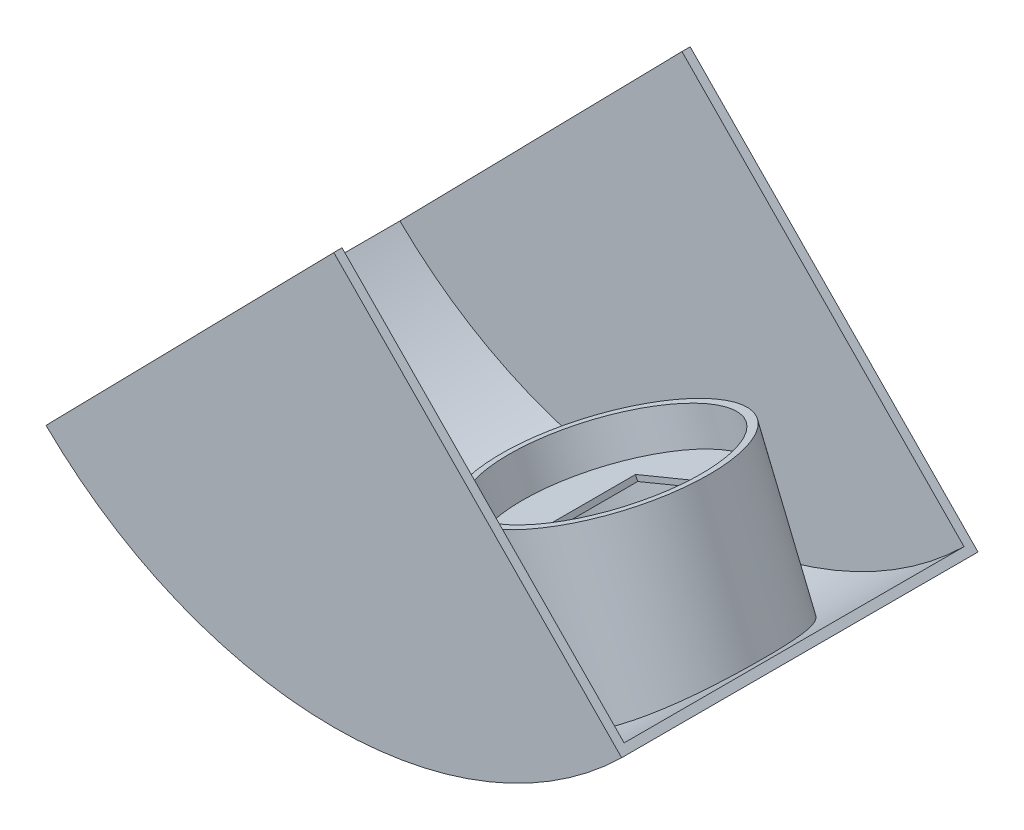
ISO-10303-21;
HEADER;
FILE_DESCRIPTION(('STEP AP214'),'2;1');
FILE_NAME('part.step','',(''),(''),'','','');
FILE_SCHEMA(('AUTOMOTIVE_DESIGN { 1 0 10303 214 1 1 1 1 }'));
ENDSEC;
DATA;
#1=APPLICATION_CONTEXT('core data for automotive mechanical design processes');
#2=APPLICATION_PROTOCOL_DEFINITION('international standard','automotive_design',2000,#1);
#3=PRODUCT_CONTEXT('',#1,'mechanical');
#4=PRODUCT('Part','Part','',(#3));
#5=PRODUCT_RELATED_PRODUCT_CATEGORY('part','',(#4));
#6=PRODUCT_DEFINITION_FORMATION('','',#4);
#7=PRODUCT_DEFINITION_CONTEXT('part definition',#1,'design');
#8=PRODUCT_DEFINITION('design','',#6,#7);
#9=PRODUCT_DEFINITION_SHAPE('','',#8);
#10=(LENGTH_UNIT() NAMED_UNIT(*) SI_UNIT(.MILLI.,.METRE.));
#11=(NAMED_UNIT(*) PLANE_ANGLE_UNIT() SI_UNIT($,.RADIAN.));
#12=(NAMED_UNIT(*) SI_UNIT($,.STERADIAN.) SOLID_ANGLE_UNIT());
#13=UNCERTAINTY_MEASURE_WITH_UNIT(LENGTH_MEASURE(1.E-05),#10,'distance_accuracy_value','');
#14=(GEOMETRIC_REPRESENTATION_CONTEXT(3) GLOBAL_UNCERTAINTY_ASSIGNED_CONTEXT((#13)) GLOBAL_UNIT_ASSIGNED_CONTEXT((#10,
#11,#12)) REPRESENTATION_CONTEXT('',''));
#15=CARTESIAN_POINT('',(0.,0.,0.));
#16=DIRECTION('',(0.,0.,1.));
#17=DIRECTION('',(1.,0.,0.));
#18=AXIS2_PLACEMENT_3D('',#15,#16,#17);
#19=CARTESIAN_POINT('',(68.1806278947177,-165.197568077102,0.));
#20=DIRECTION('',(-0.381506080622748,0.92436632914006,0.));
#21=DIRECTION('',(-0.92436632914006,-0.381506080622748,0.));
#22=AXIS2_PLACEMENT_3D('',#19,#20,#21);
#23=CYLINDRICAL_SURFACE('',#22,38.);
#24=CARTESIAN_POINT('',(20.2332278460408,-148.6291239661,0.));
#25=CARTESIAN_POINT('',(20.2332328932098,-148.629124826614,-1.04878184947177));
#26=CARTESIAN_POINT('',(20.2777466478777,-148.623084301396,-2.09764961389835));
#27=CARTESIAN_POINT('',(20.4553392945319,-148.598744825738,-4.18778060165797));
#28=CARTESIAN_POINT('',(20.5884279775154,-148.58044452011,-5.22904297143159));
#29=CARTESIAN_POINT('',(20.9418353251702,-148.531045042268,-7.29689111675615));
#30=CARTESIAN_POINT('',(21.1621980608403,-148.499939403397,-8.32346920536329));
#31=CARTESIAN_POINT('',(21.6878414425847,-148.424081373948,-10.3540863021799));
#32=CARTESIAN_POINT('',(21.9931200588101,-148.379329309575,-11.3581258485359));
#33=CARTESIAN_POINT('',(22.6850564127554,-148.275117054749,-13.3354483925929));
#34=CARTESIAN_POINT('',(23.0716052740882,-148.215676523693,-14.3087705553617));
#35=CARTESIAN_POINT('',(23.9226099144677,-148.080701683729,-16.2195643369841));
#36=CARTESIAN_POINT('',(24.3870660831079,-148.00516729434,-17.157035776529));
#37=CARTESIAN_POINT('',(25.389641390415,-147.836478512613,-18.9900658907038));
#38=CARTESIAN_POINT('',(25.9277616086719,-147.743323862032,-19.8856239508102));
#39=CARTESIAN_POINT('',(27.0729811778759,-147.537764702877,-21.6291581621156));
#40=CARTESIAN_POINT('',(27.6800815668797,-147.425359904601,-22.4771335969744));
#41=CARTESIAN_POINT('',(28.9712649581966,-147.177126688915,-24.1369698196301));
#42=CARTESIAN_POINT('',(29.6566650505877,-147.040867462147,-24.9477419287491));
#43=CARTESIAN_POINT('',(31.0883729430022,-146.74483736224,-26.5089803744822));
#44=CARTESIAN_POINT('',(31.8346815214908,-146.585066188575,-27.2594459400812));
#45=CARTESIAN_POINT('',(33.3823022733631,-146.240385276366,-28.6952105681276));
#46=CARTESIAN_POINT('',(34.1836195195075,-146.055473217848,-29.3805036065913));
#47=CARTESIAN_POINT('',(35.8349280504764,-145.65911845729,-30.6812296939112));
#48=CARTESIAN_POINT('',(36.6849195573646,-145.447675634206,-31.2966624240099));
#49=CARTESIAN_POINT('',(38.4395651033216,-144.993905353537,-32.4616979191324));
#50=CARTESIAN_POINT('',(39.3448298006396,-144.751177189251,-33.010225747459));
#51=CARTESIAN_POINT('',(41.1915383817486,-144.236527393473,-34.0268466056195));
#52=CARTESIAN_POINT('',(42.1329827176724,-143.964605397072,-34.4949386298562));
#53=CARTESIAN_POINT('',(44.0444564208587,-143.391356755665,-35.3469369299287));
#54=CARTESIAN_POINT('',(45.0144824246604,-143.09003356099,-35.730853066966));
#55=CARTESIAN_POINT('',(46.9754620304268,-142.45829880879,-36.4113835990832));
#56=CARTESIAN_POINT('',(47.9664151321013,-142.127887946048,-36.7080000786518));
#57=CARTESIAN_POINT('',(49.9405632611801,-141.44613071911,-37.2061492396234));
#58=CARTESIAN_POINT('',(50.9234917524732,-141.095361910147,-37.4095293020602));
#59=CARTESIAN_POINT('',(52.8942195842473,-140.368459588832,-37.7283956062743));
#60=CARTESIAN_POINT('',(53.8820188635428,-139.992326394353,-37.8438829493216));
#61=CARTESIAN_POINT('',(55.8547962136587,-139.216970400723,-37.9859451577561));
#62=CARTESIAN_POINT('',(56.8397746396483,-138.817750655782,-38.0125317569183));
#63=CARTESIAN_POINT('',(58.7996172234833,-137.999031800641,-37.9765893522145));
#64=CARTESIAN_POINT('',(59.7744815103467,-137.579532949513,-37.914061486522));
#65=CARTESIAN_POINT('',(61.6848843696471,-136.733468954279,-37.7028871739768));
#66=CARTESIAN_POINT('',(62.6208127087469,-136.307283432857,-37.556238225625));
#67=CARTESIAN_POINT('',(64.4698725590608,-135.442523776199,-37.1796001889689));
#68=CARTESIAN_POINT('',(65.3830044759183,-135.0039498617,-36.9496125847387));
#69=CARTESIAN_POINT('',(67.1806412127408,-134.11847551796,-36.408146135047));
#70=CARTESIAN_POINT('',(68.0651450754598,-133.671574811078,-36.0966645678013));
#71=CARTESIAN_POINT('',(69.8001282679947,-132.77385375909,-35.3946399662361));
#72=CARTESIAN_POINT('',(70.650607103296,-132.323033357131,-35.0040957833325));
#73=CARTESIAN_POINT('',(72.320314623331,-131.417967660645,-34.1429202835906));
#74=CARTESIAN_POINT('',(73.1391839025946,-130.963729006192,-33.6715853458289));
#75=CARTESIAN_POINT('',(74.73282208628,-130.060924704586,-32.654793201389));
#76=CARTESIAN_POINT('',(75.5075908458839,-129.612359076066,-32.1093357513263));
#77=CARTESIAN_POINT('',(77.0091490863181,-128.725876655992,-30.9479955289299));
#78=CARTESIAN_POINT('',(77.7359314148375,-128.287961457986,-30.3321022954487));
#79=CARTESIAN_POINT('',(79.1378390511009,-127.427935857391,-29.0340480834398));
#80=CARTESIAN_POINT('',(79.8129633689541,-127.005825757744,-28.3518858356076));
#81=CARTESIAN_POINT('',(81.1263811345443,-126.171044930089,-26.9058365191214));
#82=CARTESIAN_POINT('',(81.7631289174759,-125.758962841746,-26.1402047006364));
#83=CARTESIAN_POINT('',(82.9755720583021,-124.962317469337,-24.5486351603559));
#84=CARTESIAN_POINT('',(83.5512662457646,-124.577754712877,-23.722696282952));
#85=CARTESIAN_POINT('',(84.63881323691,-123.841441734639,-22.0158909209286));
#86=CARTESIAN_POINT('',(85.150662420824,-123.489693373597,-21.1350213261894));
#87=CARTESIAN_POINT('',(86.1079252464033,-122.824123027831,-19.3242105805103));
#88=CARTESIAN_POINT('',(86.5533391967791,-122.510300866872,-18.3942696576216));
#89=CARTESIAN_POINT('',(87.3775447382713,-121.923836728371,-16.4866595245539));
#90=CARTESIAN_POINT('',(87.7559828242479,-121.651414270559,-15.5087699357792));
#91=CARTESIAN_POINT('',(88.4413510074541,-121.154062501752,-13.516502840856));
#92=CARTESIAN_POINT('',(88.7482806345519,-120.929133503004,-12.5021250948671));
#93=CARTESIAN_POINT('',(89.2888165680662,-120.53057746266,-10.4443572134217));
#94=CARTESIAN_POINT('',(89.5224361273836,-120.356941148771,-9.40097235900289));
#95=CARTESIAN_POINT('',(89.9150154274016,-120.063941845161,-7.29275892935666));
#96=CARTESIAN_POINT('',(90.0739771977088,-119.944577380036,-6.22793093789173));
#97=CARTESIAN_POINT('',(90.3129705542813,-119.764723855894,-4.11398678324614));
#98=CARTESIAN_POINT('',(90.3950247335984,-119.702726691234,-3.06522704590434));
#99=CARTESIAN_POINT('',(90.4870393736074,-119.633185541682,-0.962757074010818));
#100=CARTESIAN_POINT('',(90.4970011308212,-119.625640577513,0.0909530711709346));
#101=CARTESIAN_POINT('',(90.4447739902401,-119.665132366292,2.19546033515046));
#102=CARTESIAN_POINT('',(90.3825913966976,-119.712164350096,3.24625770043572));
#103=CARTESIAN_POINT('',(90.1864646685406,-119.859987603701,5.33731206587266));
#104=CARTESIAN_POINT('',(90.0525208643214,-119.96077862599,6.37756911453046));
#105=CARTESIAN_POINT('',(89.7165482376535,-120.212246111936,8.42251605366));
#106=CARTESIAN_POINT('',(89.5157117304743,-120.362048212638,9.42750993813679));
#107=CARTESIAN_POINT('',(89.0465892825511,-120.709527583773,11.4131548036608));
#108=CARTESIAN_POINT('',(88.7783043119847,-120.907204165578,12.393806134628));
#109=CARTESIAN_POINT('',(88.1756901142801,-121.347380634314,14.324353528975));
#110=CARTESIAN_POINT('',(87.8413548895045,-121.589884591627,15.2742467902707));
#111=CARTESIAN_POINT('',(87.108356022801,-122.116083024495,17.1370834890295));
#112=CARTESIAN_POINT('',(86.7096910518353,-122.399778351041,18.0500261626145));
#113=CARTESIAN_POINT('',(85.8413350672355,-123.010375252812,19.8511470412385));
#114=CARTESIAN_POINT('',(85.3703786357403,-123.33802999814,20.7384599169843));
#115=CARTESIAN_POINT('',(84.365836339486,-124.027321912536,22.4630129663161));
#116=CARTESIAN_POINT('',(83.8322497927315,-124.388959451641,23.300252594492));
#117=CARTESIAN_POINT('',(82.704889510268,-125.14136181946,24.9194915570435));
#118=CARTESIAN_POINT('',(82.1111069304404,-125.532130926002,25.7014827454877));
#119=CARTESIAN_POINT('',(80.8662002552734,-126.337671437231,27.2051427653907));
#120=CARTESIAN_POINT('',(80.2150753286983,-126.752443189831,27.9268107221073));
#121=CARTESIAN_POINT('',(78.8410438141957,-127.61176691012,29.3229724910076));
#122=CARTESIAN_POINT('',(78.1167184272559,-128.05681117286,29.9957682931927));
#123=CARTESIAN_POINT('',(76.6146696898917,-128.961082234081,31.2682970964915));
#124=CARTESIAN_POINT('',(75.8369453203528,-129.420309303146,31.8680287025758));
#125=CARTESIAN_POINT('',(74.2323054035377,-130.347317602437,32.9900464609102));
#126=CARTESIAN_POINT('',(73.4053913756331,-130.81509856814,33.5123350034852));
#127=CARTESIAN_POINT('',(71.707067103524,-131.753700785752,34.4755048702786));
#128=CARTESIAN_POINT('',(70.8356575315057,-132.224521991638,34.9163874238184));
#129=CARTESIAN_POINT('',(69.0602119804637,-133.160379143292,35.7102855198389));
#130=CARTESIAN_POINT('',(68.1564646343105,-133.625432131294,36.0639262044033));
#131=CARTESIAN_POINT('',(66.3160959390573,-134.548262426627,36.6846229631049));
#132=CARTESIAN_POINT('',(65.3794746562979,-135.006039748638,36.9516792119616));
#133=CARTESIAN_POINT('',(63.4798646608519,-135.909575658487,37.3968791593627));
#134=CARTESIAN_POINT('',(62.5168803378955,-136.355336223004,37.5750375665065));
#135=CARTESIAN_POINT('',(60.5712788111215,-137.230674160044,37.840929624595));
#136=CARTESIAN_POINT('',(59.5886620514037,-137.660251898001,37.9286653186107));
#137=CARTESIAN_POINT('',(57.6385901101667,-138.487846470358,38.0117609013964));
#138=CARTESIAN_POINT('',(56.6714718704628,-138.88640851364,38.0096188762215));
#139=CARTESIAN_POINT('',(54.7326017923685,-139.661850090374,37.9191504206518));
#140=CARTESIAN_POINT('',(53.7608500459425,-140.038730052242,37.8308256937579));
#141=CARTESIAN_POINT('',(51.8199158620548,-140.768502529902,37.56874954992));
#142=CARTESIAN_POINT('',(50.8507333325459,-141.121395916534,37.3950012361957));
#143=CARTESIAN_POINT('',(48.9221146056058,-141.801524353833,36.9635294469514));
#144=CARTESIAN_POINT('',(47.9626784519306,-142.128759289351,36.7058055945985));
#145=CARTESIAN_POINT('',(46.0661360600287,-142.754694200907,36.1101767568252));
#146=CARTESIAN_POINT('',(45.128933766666,-143.053546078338,35.77273678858));
#147=CARTESIAN_POINT('',(43.2781321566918,-143.62430569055,35.0195104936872));
#148=CARTESIAN_POINT('',(42.3645326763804,-143.896213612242,34.6037247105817));
#149=CARTESIAN_POINT('',(40.5675098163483,-144.413127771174,33.6968304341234));
#150=CARTESIAN_POINT('',(39.6840893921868,-144.658131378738,33.2057145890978));
#151=CARTESIAN_POINT('',(37.953925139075,-145.121679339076,32.1516466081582));
#152=CARTESIAN_POINT('',(37.1071820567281,-145.340223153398,31.5886930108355));
#153=CARTESIAN_POINT('',(35.4362994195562,-145.756743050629,30.3801029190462));
#154=CARTESIAN_POINT('',(34.613222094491,-145.954083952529,29.7327784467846));
#155=CARTESIAN_POINT('',(33.0183602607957,-146.323128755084,28.3710992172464));
#156=CARTESIAN_POINT('',(32.2465766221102,-146.494832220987,27.6567433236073));
#157=CARTESIAN_POINT('',(30.760167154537,-146.814134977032,26.1655196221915));
#158=CARTESIAN_POINT('',(30.0455554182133,-146.961728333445,25.3886364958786));
#159=CARTESIAN_POINT('',(28.6794630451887,-147.234417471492,23.7775307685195));
#160=CARTESIAN_POINT('',(28.0279824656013,-147.359513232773,22.9433081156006));
#161=CARTESIAN_POINT('',(26.7816682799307,-147.591164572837,21.2062363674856));
#162=CARTESIAN_POINT('',(26.1881723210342,-147.697315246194,20.3023727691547));
#163=CARTESIAN_POINT('',(25.0778243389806,-147.889892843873,18.4466593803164));
#164=CARTESIAN_POINT('',(24.5609759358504,-147.976318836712,17.4948073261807));
#165=CARTESIAN_POINT('',(23.6092167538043,-148.131149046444,15.5503243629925));
#166=CARTESIAN_POINT('',(23.1742540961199,-148.19956468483,14.5577197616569));
#167=CARTESIAN_POINT('',(22.3902959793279,-148.32003294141,12.5382480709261));
#168=CARTESIAN_POINT('',(22.0412876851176,-148.372088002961,11.51138612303));
#169=CARTESIAN_POINT('',(21.4889265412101,-148.45298469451,9.62258003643));
#170=CARTESIAN_POINT('',(21.2705863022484,-148.484335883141,8.76509138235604));
#171=CARTESIAN_POINT('',(20.8951198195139,-148.537638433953,7.03660810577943));
#172=CARTESIAN_POINT('',(20.7379850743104,-148.559591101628,6.16561537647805));
#173=CARTESIAN_POINT('',(20.4860982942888,-148.594535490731,4.41454014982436));
#174=CARTESIAN_POINT('',(20.391341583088,-148.6075278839,3.53445833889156));
#175=CARTESIAN_POINT('',(20.2649002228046,-148.624822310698,1.7696051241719));
#176=CARTESIAN_POINT('',(20.2332235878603,-148.629123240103,0.884833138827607));
#177=CARTESIAN_POINT('',(20.2332278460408,-148.6291239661,0.));
#178=B_SPLINE_CURVE_WITH_KNOTS('',3,(#24,#25,#26,#27,#28,#29,#30,#31,#32,#33,#34,#35,#36,#37,
#38,#39,#40,#41,#42,#43,#44,#45,#46,#47,#48,#49,#50,#51,#52,#53,#54,#55,#56,#57,#58,#59,#60,#61,
#62,#63,#64,#65,#66,#67,#68,#69,#70,#71,#72,#73,#74,#75,#76,#77,#78,#79,#80,#81,#82,#83,#84,#85,
#86,#87,#88,#89,#90,#91,#92,#93,#94,#95,#96,#97,#98,#99,#100,#101,#102,#103,#104,#105,#106,#107,
#108,#109,#110,#111,#112,#113,#114,#115,#116,#117,#118,#119,#120,#121,#122,#123,#124,#125,#126,
#127,#128,#129,#130,#131,#132,#133,#134,#135,#136,#137,#138,#139,#140,#141,#142,#143,#144,#145,
#146,#147,#148,#149,#150,#151,#152,#153,#154,#155,#156,#157,#158,#159,#160,#161,#162,#163,#164,
#165,#166,#167,#168,#169,#170,#171,#172,#173,#174,#175,#176,#177),.UNSPECIFIED.,.T.,.F.,(4,2,2,
2,2,2,2,2,2,2,2,2,2,2,2,2,2,2,2,2,2,2,2,2,2,2,2,2,2,2,2,2,2,2,2,2,2,2,2,2,2,2,2,2,2,2,2,2,2,2,2,
2,2,2,2,2,2,2,2,2,2,2,2,2,2,2,2,2,2,2,2,2,2,2,2,2,4),(0.,3.14553625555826,6.29142027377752,
9.43889490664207,12.5862943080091,15.7295037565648,18.8727289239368,22.0160001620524,
25.1593187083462,28.366718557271,31.5741594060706,34.7818964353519,37.9896481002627,
41.2435671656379,44.4975269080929,47.7511052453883,51.0046058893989,54.1905136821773,
57.3763815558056,60.5618289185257,63.7472355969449,66.8599616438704,69.9726322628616,
73.0854068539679,76.1982266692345,79.3396790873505,82.4811418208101,85.6230717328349,
88.7650618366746,91.9943994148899,95.2237988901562,98.4533813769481,101.682948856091,
104.929084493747,108.175241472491,111.420811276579,114.666292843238,117.823806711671,
120.98126379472,124.13844498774,127.295611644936,130.399273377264,133.502890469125,
136.606789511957,139.710752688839,142.877041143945,146.043364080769,149.210152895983,
152.376987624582,155.625547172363,158.874168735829,162.122690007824,165.3711622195,
168.595632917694,171.820097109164,175.044027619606,178.267885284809,181.40219913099,
184.53645102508,187.670589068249,190.804741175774,193.921043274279,197.037323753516,
200.153908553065,203.270556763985,206.463571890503,209.656641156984,212.850495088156,
216.044351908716,219.29991616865,222.555634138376,225.809282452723,229.06244462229,
231.716491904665,234.370170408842,237.023649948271,239.677466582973),.UNSPECIFIED.);
#179=CARTESIAN_POINT('',(20.2332278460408,-148.6291239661,0.));
#180=VERTEX_POINT('',#179);
#181=EDGE_CURVE('E151',#180,#180,#178,.T.);
#182=ORIENTED_EDGE('',*,*,#181,.T.);
#183=EDGE_LOOP('',(#182));
#184=FACE_BOUND('',#183,.T.);
#185=CARTESIAN_POINT('',(39.7062289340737,-96.2058088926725,0.));
#186=DIRECTION('',(-0.381506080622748,0.92436632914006,0.));
#187=DIRECTION('',(-0.92436632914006,-0.381506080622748,0.));
#188=AXIS2_PLACEMENT_3D('',#185,#186,#187);
#189=CIRCLE('',#188,38.);
#190=CARTESIAN_POINT('',(4.58030842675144,-110.703039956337,0.));
#191=VERTEX_POINT('',#190);
#192=EDGE_CURVE('E11',#191,#191,#189,.F.);
#193=ORIENTED_EDGE('',*,*,#192,.F.);
#194=EDGE_LOOP('',(#193));
#195=FACE_BOUND('',#194,.T.);
#196=ADVANCED_FACE('F32',(#184,#195),#23,.F.);
#197=CARTESIAN_POINT('',(0.,0.,65.));
#198=DIRECTION('',(-0.714142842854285,-0.7,0.));
#199=DIRECTION('',(0.7,-0.714142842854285,0.));
#200=AXIS2_PLACEMENT_3D('',#197,#198,#199);
#201=PLANE('',#200);
#202=DIRECTION('',(-0.7,0.714142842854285,0.));
#203=VECTOR('',#202,1.);
#204=CARTESIAN_POINT('',(0.,0.,-62.));
#205=LINE('',#204,#203);
#206=CARTESIAN_POINT('',(102.9,-104.97899789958,-62.));
#207=VERTEX_POINT('',#206);
#208=CARTESIAN_POINT('',(0.,0.,-62.));
#209=VERTEX_POINT('',#208);
#210=EDGE_CURVE('E222',#207,#209,#205,.T.);
#211=ORIENTED_EDGE('',*,*,#210,.F.);
#212=DIRECTION('',(0.,0.,1.));
#213=VECTOR('',#212,1.);
#214=CARTESIAN_POINT('',(102.9,-104.97899789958,-62.));
#215=LINE('',#214,#213);
#216=CARTESIAN_POINT('',(102.9,-104.97899789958,62.));
#217=VERTEX_POINT('',#216);
#218=EDGE_CURVE('E230',#207,#217,#215,.T.);
#219=ORIENTED_EDGE('',*,*,#218,.T.);
#220=DIRECTION('',(-0.7,0.714142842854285,0.));
#221=VECTOR('',#220,1.);
#222=CARTESIAN_POINT('',(0.,0.,62.));
#223=LINE('',#222,#221);
#224=CARTESIAN_POINT('',(0.,0.,62.));
#225=VERTEX_POINT('',#224);
#226=EDGE_CURVE('E211',#217,#225,#223,.T.);
#227=ORIENTED_EDGE('',*,*,#226,.T.);
#228=DIRECTION('',(0.,0.,-1.));
#229=VECTOR('',#228,1.);
#230=CARTESIAN_POINT('',(0.,0.,65.));
#231=LINE('',#230,#229);
#232=CARTESIAN_POINT('',(0.,0.,65.));
#233=VERTEX_POINT('',#232);
#234=EDGE_CURVE('E40',#233,#225,#231,.T.);
#235=ORIENTED_EDGE('',*,*,#234,.F.);
#236=DIRECTION('',(-0.7,0.714142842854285,0.));
#237=VECTOR('',#236,1.);
#238=CARTESIAN_POINT('',(0.,0.,65.));
#239=LINE('',#238,#237);
#240=CARTESIAN_POINT('',(105.,-107.121426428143,65.));
#241=VERTEX_POINT('',#240);
#242=EDGE_CURVE('E242',#241,#233,#239,.T.);
#243=ORIENTED_EDGE('',*,*,#242,.F.);
#244=DIRECTION('',(0.,0.,-1.));
#245=VECTOR('',#244,1.);
#246=CARTESIAN_POINT('',(105.,-107.121426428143,65.));
#247=LINE('',#246,#245);
#248=CARTESIAN_POINT('',(105.,-107.121426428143,-65.));
#249=VERTEX_POINT('',#248);
#250=EDGE_CURVE('E249',#241,#249,#247,.T.);
#251=ORIENTED_EDGE('',*,*,#250,.T.);
#252=DIRECTION('',(-0.7,0.714142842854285,0.));
#253=VECTOR('',#252,1.);
#254=CARTESIAN_POINT('',(0.,0.,-65.));
#255=LINE('',#254,#253);
#256=CARTESIAN_POINT('',(0.,0.,-65.));
#257=VERTEX_POINT('',#256);
#258=EDGE_CURVE('E233',#249,#257,#255,.T.);
#259=ORIENTED_EDGE('',*,*,#258,.T.);
#260=EDGE_CURVE('E254',#209,#257,#231,.T.);
#261=ORIENTED_EDGE('',*,*,#260,.F.);
#262=EDGE_LOOP('',(#211,#219,#227,#235,#243,#251,#259,#261));
#263=FACE_BOUND('',#262,.T.);
#264=ADVANCED_FACE('F34',(#263),#201,.F.);
#265=CARTESIAN_POINT('',(0.,0.,65.));
#266=DIRECTION('',(0.714142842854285,-0.7,0.));
#267=DIRECTION('',(0.7,0.714142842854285,0.));
#268=AXIS2_PLACEMENT_3D('',#265,#266,#267);
#269=PLANE('',#268);
#270=DIRECTION('',(-0.7,-0.714142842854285,0.));
#271=VECTOR('',#270,1.);
#272=CARTESIAN_POINT('',(-102.9,-104.97899789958,-62.));
#273=LINE('',#272,#271);
#274=CARTESIAN_POINT('',(-102.9,-104.97899789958,-62.));
#275=VERTEX_POINT('',#274);
#276=EDGE_CURVE('E224',#209,#275,#273,.T.);
#277=ORIENTED_EDGE('',*,*,#276,.F.);
#278=ORIENTED_EDGE('',*,*,#260,.T.);
#279=DIRECTION('',(-0.7,-0.714142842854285,0.));
#280=VECTOR('',#279,1.);
#281=CARTESIAN_POINT('',(0.,0.,-65.));
#282=LINE('',#281,#280);
#283=CARTESIAN_POINT('',(-105.,-107.121426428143,-65.));
#284=VERTEX_POINT('',#283);
#285=EDGE_CURVE('E238',#257,#284,#282,.T.);
#286=ORIENTED_EDGE('',*,*,#285,.T.);
#287=DIRECTION('',(0.,0.,-1.));
#288=VECTOR('',#287,1.);
#289=CARTESIAN_POINT('',(-105.,-107.121426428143,65.));
#290=LINE('',#289,#288);
#291=CARTESIAN_POINT('',(-105.,-107.121426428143,65.));
#292=VERTEX_POINT('',#291);
#293=EDGE_CURVE('E252',#292,#284,#290,.T.);
#294=ORIENTED_EDGE('',*,*,#293,.F.);
#295=DIRECTION('',(-0.7,-0.714142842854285,0.));
#296=VECTOR('',#295,1.);
#297=CARTESIAN_POINT('',(0.,0.,65.));
#298=LINE('',#297,#296);
#299=EDGE_CURVE('E245',#233,#292,#298,.T.);
#300=ORIENTED_EDGE('',*,*,#299,.F.);
#301=ORIENTED_EDGE('',*,*,#234,.T.);
#302=DIRECTION('',(-0.7,-0.714142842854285,0.));
#303=VECTOR('',#302,1.);
#304=CARTESIAN_POINT('',(-102.9,-104.97899789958,62.));
#305=LINE('',#304,#303);
#306=CARTESIAN_POINT('',(-102.9,-104.97899789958,62.));
#307=VERTEX_POINT('',#306);
#308=EDGE_CURVE('E213',#225,#307,#305,.T.);
#309=ORIENTED_EDGE('',*,*,#308,.T.);
#310=DIRECTION('',(0.,0.,1.));
#311=VECTOR('',#310,1.);
#312=CARTESIAN_POINT('',(-102.9,-104.97899789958,-62.));
#313=LINE('',#312,#311);
#314=EDGE_CURVE('E229',#275,#307,#313,.T.);
#315=ORIENTED_EDGE('',*,*,#314,.F.);
#316=EDGE_LOOP('',(#277,#278,#286,#294,#300,#301,#309,#315));
#317=FACE_BOUND('',#316,.T.);
#318=ADVANCED_FACE('F191',(#317),#269,.F.);
#319=CARTESIAN_POINT('',(0.,0.,65.));
#320=DIRECTION('',(0.,0.,-1.));
#321=DIRECTION('',(-1.,0.,0.));
#322=AXIS2_PLACEMENT_3D('',#319,#320,#321);
#323=CYLINDRICAL_SURFACE('',#322,150.);
#324=ORIENTED_EDGE('',*,*,#181,.F.);
#325=EDGE_LOOP('',(#324));
#326=FACE_BOUND('',#325,.T.);
#327=CARTESIAN_POINT('',(0.,0.,-65.));
#328=DIRECTION('',(0.,0.,1.));
#329=DIRECTION('',(1.,0.,0.));
#330=AXIS2_PLACEMENT_3D('',#327,#328,#329);
#331=CIRCLE('',#330,150.);
#332=EDGE_CURVE('E240',#284,#249,#331,.T.);
#333=ORIENTED_EDGE('',*,*,#332,.T.);
#334=ORIENTED_EDGE('',*,*,#250,.F.);
#335=CARTESIAN_POINT('',(0.,0.,65.));
#336=DIRECTION('',(0.,0.,1.));
#337=DIRECTION('',(1.,0.,0.));
#338=AXIS2_PLACEMENT_3D('',#335,#336,#337);
#339=CIRCLE('',#338,150.);
#340=EDGE_CURVE('E247',#292,#241,#339,.T.);
#341=ORIENTED_EDGE('',*,*,#340,.F.);
#342=ORIENTED_EDGE('',*,*,#293,.T.);
#343=EDGE_LOOP('',(#333,#334,#341,#342));
#344=FACE_BOUND('',#343,.T.);
#345=ADVANCED_FACE('F272',(#326,#344),#323,.T.);
#346=CARTESIAN_POINT('',(0.,0.,65.));
#347=DIRECTION('',(0.,0.,1.));
#348=DIRECTION('',(1.,0.,0.));
#349=AXIS2_PLACEMENT_3D('',#346,#347,#348);
#350=PLANE('',#349);
#351=ORIENTED_EDGE('',*,*,#242,.T.);
#352=ORIENTED_EDGE('',*,*,#299,.T.);
#353=ORIENTED_EDGE('',*,*,#340,.T.);
#354=EDGE_LOOP('',(#351,#352,#353));
#355=FACE_BOUND('',#354,.T.);
#356=ADVANCED_FACE('F274',(#355),#350,.T.);
#357=CARTESIAN_POINT('',(0.,0.,-65.));
#358=DIRECTION('',(0.,0.,1.));
#359=DIRECTION('',(1.,0.,0.));
#360=AXIS2_PLACEMENT_3D('',#357,#358,#359);
#361=PLANE('',#360);
#362=ORIENTED_EDGE('',*,*,#258,.F.);
#363=ORIENTED_EDGE('',*,*,#332,.F.);
#364=ORIENTED_EDGE('',*,*,#285,.F.);
#365=EDGE_LOOP('',(#362,#363,#364));
#366=FACE_BOUND('',#365,.T.);
#367=ADVANCED_FACE('F267',(#366),#361,.F.);
#368=CARTESIAN_POINT('',(0.,0.,-62.));
#369=DIRECTION('',(0.,0.,1.));
#370=DIRECTION('',(1.,0.,0.));
#371=AXIS2_PLACEMENT_3D('',#368,#369,#370);
#372=CYLINDRICAL_SURFACE('',#371,147.);
#373=CARTESIAN_POINT('',(15.9568846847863,-146.13137182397,0.));
#374=CARTESIAN_POINT('',(15.9568888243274,-146.131372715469,-1.12726042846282));
#375=CARTESIAN_POINT('',(16.0050598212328,-146.126135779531,-2.25458529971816));
#376=CARTESIAN_POINT('',(16.1972087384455,-146.104960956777,-4.50098240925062));
#377=CARTESIAN_POINT('',(16.3411940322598,-146.089022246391,-5.62005400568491));
#378=CARTESIAN_POINT('',(16.7234230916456,-146.04576016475,-7.84219791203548));
#379=CARTESIAN_POINT('',(16.961703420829,-146.018432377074,-8.94526384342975));
#380=CARTESIAN_POINT('',(17.5299082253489,-145.951307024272,-11.1271021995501));
#381=CARTESIAN_POINT('',(17.859831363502,-145.91150964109,-12.2058749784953));
#382=CARTESIAN_POINT('',(18.6072902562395,-145.818072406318,-14.330131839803));
#383=CARTESIAN_POINT('',(19.0246917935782,-145.764453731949,-15.3756641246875));
#384=CARTESIAN_POINT('',(19.9432663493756,-145.641617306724,-17.4282807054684));
#385=CARTESIAN_POINT('',(20.444439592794,-145.572399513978,-18.4353648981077));
#386=CARTESIAN_POINT('',(21.5258969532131,-145.416416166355,-20.4047584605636));
#387=CARTESIAN_POINT('',(22.106186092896,-145.329649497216,-21.3670649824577));
#388=CARTESIAN_POINT('',(23.3407310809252,-145.136489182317,-23.2409189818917));
#389=CARTESIAN_POINT('',(23.9949883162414,-145.030095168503,-24.1524655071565));
#390=CARTESIAN_POINT('',(25.3890599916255,-144.792636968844,-25.9411526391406));
#391=CARTESIAN_POINT('',(26.1305912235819,-144.661027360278,-26.816883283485));
#392=CARTESIAN_POINT('',(27.679405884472,-144.372680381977,-28.5036838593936));
#393=CARTESIAN_POINT('',(28.4866903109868,-144.215942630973,-29.3147528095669));
#394=CARTESIAN_POINT('',(30.1606209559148,-143.875176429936,-30.8670865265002));
#395=CARTESIAN_POINT('',(31.027273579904,-143.69114503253,-31.6083437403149));
#396=CARTESIAN_POINT('',(32.813088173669,-143.293886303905,-33.0160273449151));
#397=CARTESIAN_POINT('',(33.7322504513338,-143.080658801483,-33.6824532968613));
#398=CARTESIAN_POINT('',(35.6326862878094,-142.619368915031,-34.9469406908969));
#399=CARTESIAN_POINT('',(36.6147711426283,-142.370756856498,-35.5435836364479));
#400=CARTESIAN_POINT('',(38.618183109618,-141.840436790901,-36.6500363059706));
#401=CARTESIAN_POINT('',(39.6395108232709,-141.558728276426,-37.1598446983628));
#402=CARTESIAN_POINT('',(41.7130694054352,-140.961638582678,-38.0884484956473));
#403=CARTESIAN_POINT('',(42.7652958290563,-140.646262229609,-38.5072569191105));
#404=CARTESIAN_POINT('',(44.8922614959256,-139.981877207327,-39.2503743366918));
#405=CARTESIAN_POINT('',(45.9670000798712,-139.632869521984,-39.5746860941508));
#406=CARTESIAN_POINT('',(48.1032363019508,-138.911187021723,-40.1190419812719));
#407=CARTESIAN_POINT('',(49.1643957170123,-138.539319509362,-40.3414847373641));
#408=CARTESIAN_POINT('',(51.2915248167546,-137.765960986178,-40.6918122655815));
#409=CARTESIAN_POINT('',(52.3574944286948,-137.36447042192,-40.8196984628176));
#410=CARTESIAN_POINT('',(54.4858134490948,-136.534247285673,-40.9797389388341));
#411=CARTESIAN_POINT('',(55.5481634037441,-136.105519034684,-41.0119083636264));
#412=CARTESIAN_POINT('',(57.6613048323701,-135.223831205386,-40.9802608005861));
#413=CARTESIAN_POINT('',(58.7120964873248,-134.770872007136,-40.9164453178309));
#414=CARTESIAN_POINT('',(60.7655684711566,-133.857288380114,-40.6965043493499));
#415=CARTESIAN_POINT('',(61.7687761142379,-133.397220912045,-40.5429762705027));
#416=CARTESIAN_POINT('',(63.7501597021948,-132.461758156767,-40.147042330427));
#417=CARTESIAN_POINT('',(64.7283361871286,-131.986363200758,-39.9046383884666));
#418=CARTESIAN_POINT('',(66.6534783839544,-131.024698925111,-39.3329511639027));
#419=CARTESIAN_POINT('',(67.6004429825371,-130.538429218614,-39.0036647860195));
#420=CARTESIAN_POINT('',(69.4574868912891,-129.559867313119,-38.2608331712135));
#421=CARTESIAN_POINT('',(70.367565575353,-129.067575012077,-37.8472865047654));
#422=CARTESIAN_POINT('',(72.1551597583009,-128.07688415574,-36.9342686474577));
#423=CARTESIAN_POINT('',(73.0322299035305,-127.57847601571,-36.4339362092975));
#424=CARTESIAN_POINT('',(74.7388950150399,-126.586223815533,-35.3540896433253));
#425=CARTESIAN_POINT('',(75.5684898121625,-126.092379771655,-34.7745752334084));
#426=CARTESIAN_POINT('',(77.1762786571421,-125.114777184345,-33.5402712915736));
#427=CARTESIAN_POINT('',(77.9544636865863,-124.631020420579,-32.8854686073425));
#428=CARTESIAN_POINT('',(79.4556981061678,-123.679351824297,-31.5049749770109));
#429=CARTESIAN_POINT('',(80.1787462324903,-123.211440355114,-30.779282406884));
#430=CARTESIAN_POINT('',(81.5897955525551,-122.281817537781,-29.2361251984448));
#431=CARTESIAN_POINT('',(82.2758091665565,-121.820839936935,-28.416399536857));
#432=CARTESIAN_POINT('',(83.5823930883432,-120.928118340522,-26.7114606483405));
#433=CARTESIAN_POINT('',(84.2029618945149,-120.496375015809,-25.8262459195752));
#434=CARTESIAN_POINT('',(85.3758537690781,-119.668204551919,-23.9959625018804));
#435=CARTESIAN_POINT('',(85.928171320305,-119.271780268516,-23.0508889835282));
#436=CARTESIAN_POINT('',(86.9619038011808,-118.520191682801,-21.1070669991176));
#437=CARTESIAN_POINT('',(87.443319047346,-118.165027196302,-20.1083187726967));
#438=CARTESIAN_POINT('',(88.3361534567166,-117.499091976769,-18.0562073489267));
#439=CARTESIAN_POINT('',(88.7470329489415,-117.188666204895,-17.002497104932));
#440=CARTESIAN_POINT('',(89.4922771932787,-116.620547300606,-14.8545388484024));
#441=CARTESIAN_POINT('',(89.8266412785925,-116.36285462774,-13.7602904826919));
#442=CARTESIAN_POINT('',(90.4168994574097,-115.904805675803,-11.539363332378));
#443=CARTESIAN_POINT('',(90.6728112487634,-115.704436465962,-10.4126919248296));
#444=CARTESIAN_POINT('',(91.1047281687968,-115.364657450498,-8.13510375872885));
#445=CARTESIAN_POINT('',(91.2807360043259,-115.225245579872,-6.98418782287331));
#446=CARTESIAN_POINT('',(91.5473384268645,-115.013533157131,-4.70470628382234));
#447=CARTESIAN_POINT('',(91.6405263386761,-114.939196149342,-3.57663229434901));
#448=CARTESIAN_POINT('',(91.7505269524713,-114.851407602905,-1.31441420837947));
#449=CARTESIAN_POINT('',(91.7673413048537,-114.837954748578,-0.180270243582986));
#450=CARTESIAN_POINT('',(91.7244958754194,-114.872179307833,2.0855186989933));
#451=CARTESIAN_POINT('',(91.6648443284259,-114.919850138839,3.21716393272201));
#452=CARTESIAN_POINT('',(91.4694465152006,-115.075435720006,5.46968016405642));
#453=CARTESIAN_POINT('',(91.3337007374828,-115.183350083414,6.59055123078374));
#454=CARTESIAN_POINT('',(90.9906752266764,-115.454508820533,8.78933350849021));
#455=CARTESIAN_POINT('',(90.7850022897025,-115.616509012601,9.86764981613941));
#456=CARTESIAN_POINT('',(90.3027277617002,-115.993581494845,11.9988028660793));
#457=CARTESIAN_POINT('',(90.0261274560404,-116.208652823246,13.0516400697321));
#458=CARTESIAN_POINT('',(89.40340686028,-116.688410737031,15.1250514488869));
#459=CARTESIAN_POINT('',(89.0572793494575,-116.953102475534,16.1456222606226));
#460=CARTESIAN_POINT('',(88.2972187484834,-117.527988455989,18.1479583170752));
#461=CARTESIAN_POINT('',(87.8832839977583,-117.838183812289,19.129722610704));
#462=CARTESIAN_POINT('',(86.9789081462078,-118.507355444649,21.0712306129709));
#463=CARTESIAN_POINT('',(86.4868839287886,-118.867315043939,22.029898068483));
#464=CARTESIAN_POINT('',(85.4360437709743,-119.624837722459,23.8942954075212));
#465=CARTESIAN_POINT('',(84.8772269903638,-120.022401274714,24.8000246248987));
#466=CARTESIAN_POINT('',(83.6951696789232,-120.849654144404,26.5531417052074));
#467=CARTESIAN_POINT('',(83.0719176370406,-121.279349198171,27.400519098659));
#468=CARTESIAN_POINT('',(81.7637817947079,-122.165084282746,29.0315492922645));
#469=CARTESIAN_POINT('',(81.0788968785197,-122.621124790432,29.815200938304));
#470=CARTESIAN_POINT('',(79.6276046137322,-123.568682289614,31.3378752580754));
#471=CARTESIAN_POINT('',(78.8592890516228,-124.060867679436,32.074665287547));
#472=CARTESIAN_POINT('',(77.2638982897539,-125.060689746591,33.4700486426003));
#473=CARTESIAN_POINT('',(76.4368217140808,-125.568326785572,34.1286401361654));
#474=CARTESIAN_POINT('',(74.7281473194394,-126.592637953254,35.3628247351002));
#475=CARTESIAN_POINT('',(73.8465510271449,-127.109311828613,35.9384201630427));
#476=CARTESIAN_POINT('',(72.0336339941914,-128.145407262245,37.0022134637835));
#477=CARTESIAN_POINT('',(71.1023141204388,-128.664828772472,37.4904128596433));
#478=CARTESIAN_POINT('',(69.2027681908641,-129.696321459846,38.3720510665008));
#479=CARTESIAN_POINT('',(68.2348815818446,-130.208418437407,38.7661906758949));
#480=CARTESIAN_POINT('',(66.261586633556,-131.223599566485,39.4611931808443));
#481=CARTESIAN_POINT('',(65.2561783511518,-131.726683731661,39.7620562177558));
#482=CARTESIAN_POINT('',(63.2148103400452,-132.718405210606,40.2677868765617));
#483=CARTESIAN_POINT('',(62.1788568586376,-133.207045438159,40.4726739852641));
#484=CARTESIAN_POINT('',(60.0836228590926,-134.165140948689,40.7846541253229));
#485=CARTESIAN_POINT('',(59.0243429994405,-134.634596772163,40.8917499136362));
#486=CARTESIAN_POINT('',(56.9261756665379,-135.53475515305,41.0052187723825));
#487=CARTESIAN_POINT('',(55.8877937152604,-135.966229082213,41.0148456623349));
#488=CARTESIAN_POINT('',(53.8042144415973,-136.804120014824,40.9417407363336));
#489=CARTESIAN_POINT('',(52.7590172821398,-137.210537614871,40.8590111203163));
#490=CARTESIAN_POINT('',(50.6696020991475,-137.995786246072,40.6019311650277));
#491=CARTESIAN_POINT('',(49.6253840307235,-138.374618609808,40.427585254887));
#492=CARTESIAN_POINT('',(47.5456869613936,-139.102917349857,39.9887821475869));
#493=CARTESIAN_POINT('',(46.5102079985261,-139.452383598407,39.7243245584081));
#494=CARTESIAN_POINT('',(44.4641842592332,-140.118108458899,39.1100459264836));
#495=CARTESIAN_POINT('',(43.4535046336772,-140.434615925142,38.7609428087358));
#496=CARTESIAN_POINT('',(41.4557778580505,-141.037254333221,37.9790348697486));
#497=CARTESIAN_POINT('',(40.4687304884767,-141.323385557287,37.5462308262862));
#498=CARTESIAN_POINT('',(38.5253019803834,-141.865496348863,36.6001088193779));
#499=CARTESIAN_POINT('',(37.5689243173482,-142.121472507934,36.0867817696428));
#500=CARTESIAN_POINT('',(35.6938099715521,-142.60395973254,34.9832857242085));
#501=CARTESIAN_POINT('',(34.7750741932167,-142.830470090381,34.3931148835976));
#502=CARTESIAN_POINT('',(32.9561336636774,-143.261270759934,33.1219320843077));
#503=CARTESIAN_POINT('',(32.0572138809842,-143.464738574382,32.4388020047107));
#504=CARTESIAN_POINT('',(30.3130323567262,-143.843375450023,31.0000433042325));
#505=CARTESIAN_POINT('',(29.46777162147,-144.018543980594,30.244413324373));
#506=CARTESIAN_POINT('',(27.8372612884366,-144.342571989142,28.6653588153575));
#507=CARTESIAN_POINT('',(27.0520271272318,-144.491424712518,27.8419169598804));
#508=CARTESIAN_POINT('',(25.5480907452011,-144.764910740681,26.1326134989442));
#509=CARTESIAN_POINT('',(24.8293889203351,-144.889543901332,25.2467515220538));
#510=CARTESIAN_POINT('',(23.4476263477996,-145.11964577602,23.3955189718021));
#511=CARTESIAN_POINT('',(22.7863802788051,-145.224564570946,22.4287242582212));
#512=CARTESIAN_POINT('',(21.546129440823,-145.413747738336,20.4417502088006));
#513=CARTESIAN_POINT('',(20.9671282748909,-145.498011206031,19.4215685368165));
#514=CARTESIAN_POINT('',(19.8973535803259,-145.648161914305,17.3353127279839));
#515=CARTESIAN_POINT('',(19.4065341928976,-145.714058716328,16.2692628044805));
#516=CARTESIAN_POINT('',(18.5179078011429,-145.829654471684,14.0982966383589));
#517=CARTESIAN_POINT('',(18.1200893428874,-145.879355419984,12.9933852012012));
#518=CARTESIAN_POINT('',(17.4721074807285,-145.95826753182,10.9141725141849));
#519=CARTESIAN_POINT('',(17.2089304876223,-145.989398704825,9.94397725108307));
#520=CARTESIAN_POINT('',(16.7561130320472,-146.042065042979,7.98638545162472));
#521=CARTESIAN_POINT('',(16.5664643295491,-146.063601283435,6.99899085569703));
#522=CARTESIAN_POINT('',(16.2623643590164,-146.097771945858,5.01264786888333));
#523=CARTESIAN_POINT('',(16.1479042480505,-146.110407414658,4.01370085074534));
#524=CARTESIAN_POINT('',(15.9951589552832,-146.127207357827,2.00985333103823));
#525=CARTESIAN_POINT('',(15.9568809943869,-146.131371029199,1.00495227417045));
#526=CARTESIAN_POINT('',(15.9568846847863,-146.13137182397,0.));
#527=B_SPLINE_CURVE_WITH_KNOTS('',3,(#373,#374,#375,#376,#377,#378,#379,#380,#381,#382,#383,
#384,#385,#386,#387,#388,#389,#390,#391,#392,#393,#394,#395,#396,#397,#398,#399,#400,#401,#402,
#403,#404,#405,#406,#407,#408,#409,#410,#411,#412,#413,#414,#415,#416,#417,#418,#419,#420,#421,
#422,#423,#424,#425,#426,#427,#428,#429,#430,#431,#432,#433,#434,#435,#436,#437,#438,#439,#440,
#441,#442,#443,#444,#445,#446,#447,#448,#449,#450,#451,#452,#453,#454,#455,#456,#457,#458,#459,
#460,#461,#462,#463,#464,#465,#466,#467,#468,#469,#470,#471,#472,#473,#474,#475,#476,#477,#478,
#479,#480,#481,#482,#483,#484,#485,#486,#487,#488,#489,#490,#491,#492,#493,#494,#495,#496,#497,
#498,#499,#500,#501,#502,#503,#504,#505,#506,#507,#508,#509,#510,#511,#512,#513,#514,#515,#516,
#517,#518,#519,#520,#521,#522,#523,#524,#525,#526),.UNSPECIFIED.,.T.,.F.,(4,2,2,2,2,2,2,2,2,2,2,
2,2,2,2,2,2,2,2,2,2,2,2,2,2,2,2,2,2,2,2,2,2,2,2,2,2,2,2,2,2,2,2,2,2,2,2,2,2,2,2,2,2,2,2,2,2,2,2,
2,2,2,2,2,2,2,2,2,2,2,2,2,2,2,2,2,4),(0.,3.38085625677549,6.76197272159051,10.1444015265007,
13.52678098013,16.9040083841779,20.2812448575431,23.658695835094,27.0362101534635,
30.4973195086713,33.9584813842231,37.4200172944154,40.8815735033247,44.4043864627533,
47.9272534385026,51.4496160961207,54.9718757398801,58.4062936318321,61.8406597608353,
65.2744824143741,68.708251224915,72.0472107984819,75.3860982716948,78.7251047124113,
82.0641678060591,85.4384914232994,88.8128270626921,92.1877530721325,95.5627564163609,
99.0509058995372,102.539135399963,106.027646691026,109.516142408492,113.030242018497,
116.544372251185,120.057709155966,123.570927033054,126.969808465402,130.368616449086,
133.767058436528,137.16547860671,140.490566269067,143.81559367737,147.140966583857,
150.466420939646,153.870830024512,157.275281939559,160.680343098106,164.085465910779,
167.599626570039,171.113869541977,174.628014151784,178.14209751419,181.629118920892,
185.116135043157,188.602442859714,192.088652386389,195.45808146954,198.827430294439,
202.196616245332,205.565816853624,208.907383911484,212.248919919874,215.590833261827,
218.932826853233,222.370565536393,225.808368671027,229.247052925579,232.685757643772,
236.209468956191,239.733334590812,243.255362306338,246.776956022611,249.79139500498,
252.805496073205,255.819242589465,258.833274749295),.UNSPECIFIED.);
#528=CARTESIAN_POINT('',(15.9568846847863,-146.13137182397,0.));
#529=VERTEX_POINT('',#528);
#530=EDGE_CURVE('E158',#529,#529,#527,.T.);
#531=ORIENTED_EDGE('',*,*,#530,.T.);
#532=EDGE_LOOP('',(#531));
#533=FACE_BOUND('',#532,.T.);
#534=CARTESIAN_POINT('',(0.,0.,62.));
#535=DIRECTION('',(0.,0.,1.));
#536=DIRECTION('',(1.,0.,0.));
#537=AXIS2_PLACEMENT_3D('',#534,#535,#536);
#538=CIRCLE('',#537,147.);
#539=EDGE_CURVE('E219',#307,#217,#538,.T.);
#540=ORIENTED_EDGE('',*,*,#539,.T.);
#541=ORIENTED_EDGE('',*,*,#218,.F.);
#542=CARTESIAN_POINT('',(0.,0.,-62.));
#543=DIRECTION('',(0.,0.,1.));
#544=DIRECTION('',(1.,0.,0.));
#545=AXIS2_PLACEMENT_3D('',#542,#543,#544);
#546=CIRCLE('',#545,147.);
#547=EDGE_CURVE('E226',#275,#207,#546,.T.);
#548=ORIENTED_EDGE('',*,*,#547,.F.);
#549=ORIENTED_EDGE('',*,*,#314,.T.);
#550=EDGE_LOOP('',(#540,#541,#548,#549));
#551=FACE_BOUND('',#550,.T.);
#552=ADVANCED_FACE('F278',(#533,#551),#372,.F.);
#553=CARTESIAN_POINT('',(0.,0.,-62.));
#554=DIRECTION('',(0.,0.,1.));
#555=DIRECTION('',(1.,0.,0.));
#556=AXIS2_PLACEMENT_3D('',#553,#554,#555);
#557=PLANE('',#556);
#558=ORIENTED_EDGE('',*,*,#210,.T.);
#559=ORIENTED_EDGE('',*,*,#276,.T.);
#560=ORIENTED_EDGE('',*,*,#547,.T.);
#561=EDGE_LOOP('',(#558,#559,#560));
#562=FACE_BOUND('',#561,.T.);
#563=ADVANCED_FACE('F281',(#562),#557,.T.);
#564=CARTESIAN_POINT('',(0.,0.,62.));
#565=DIRECTION('',(0.,0.,1.));
#566=DIRECTION('',(1.,0.,0.));
#567=AXIS2_PLACEMENT_3D('',#564,#565,#566);
#568=PLANE('',#567);
#569=ORIENTED_EDGE('',*,*,#226,.F.);
#570=ORIENTED_EDGE('',*,*,#539,.F.);
#571=ORIENTED_EDGE('',*,*,#308,.F.);
#572=EDGE_LOOP('',(#569,#570,#571));
#573=FACE_BOUND('',#572,.T.);
#574=ADVANCED_FACE('F276',(#573),#568,.F.);
#575=CARTESIAN_POINT('',(33.9836377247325,-82.3403139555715,0.));
#576=DIRECTION('',(0.381506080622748,-0.92436632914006,0.));
#577=DIRECTION('',(0.92436632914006,0.381506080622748,0.));
#578=AXIS2_PLACEMENT_3D('',#575,#576,#577);
#579=CYLINDRICAL_SURFACE('',#578,41.);
#580=CARTESIAN_POINT('',(33.9836377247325,-82.3403139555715,0.));
#581=DIRECTION('',(0.381506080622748,-0.92436632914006,0.));
#582=DIRECTION('',(0.92436632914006,0.381506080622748,0.));
#583=AXIS2_PLACEMENT_3D('',#580,#581,#582);
#584=CIRCLE('',#583,41.);
#585=CARTESIAN_POINT('',(71.882657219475,-66.6985646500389,0.));
#586=VERTEX_POINT('',#585);
#587=EDGE_CURVE('E209',#586,#586,#584,.T.);
#588=ORIENTED_EDGE('',*,*,#587,.T.);
#589=EDGE_LOOP('',(#588));
#590=FACE_BOUND('',#589,.T.);
#591=ORIENTED_EDGE('',*,*,#530,.F.);
#592=EDGE_LOOP('',(#591));
#593=FACE_BOUND('',#592,.T.);
#594=ADVANCED_FACE('F200',(#590,#593),#579,.T.);
#595=CARTESIAN_POINT('',(33.9836377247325,-82.3403139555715,0.));
#596=DIRECTION('',(0.381506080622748,-0.92436632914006,0.));
#597=DIRECTION('',(0.92436632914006,0.381506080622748,0.));
#598=AXIS2_PLACEMENT_3D('',#595,#596,#597);
#599=PLANE('',#598);
#600=CARTESIAN_POINT('',(33.9836377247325,-82.3403139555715,0.));
#601=DIRECTION('',(-0.381506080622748,0.92436632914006,0.));
#602=DIRECTION('',(-0.92436632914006,-0.381506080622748,0.));
#603=AXIS2_PLACEMENT_3D('',#600,#601,#602);
#604=CIRCLE('',#603,38.);
#605=CARTESIAN_POINT('',(-1.14228278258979,-96.8375450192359,0.));
#606=VERTEX_POINT('',#605);
#607=EDGE_CURVE('E148',#606,#606,#604,.T.);
#608=ORIENTED_EDGE('',*,*,#607,.F.);
#609=EDGE_LOOP('',(#608));
#610=FACE_BOUND('',#609,.T.);
#611=ORIENTED_EDGE('',*,*,#587,.F.);
#612=EDGE_LOOP('',(#611));
#613=FACE_BOUND('',#612,.T.);
#614=ADVANCED_FACE('F195',(#610,#613),#599,.F.);
#615=CARTESIAN_POINT('',(38.9432167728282,-94.3570762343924,0.));
#616=DIRECTION('',(-0.381506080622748,0.92436632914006,0.));
#617=DIRECTION('',(-0.92436632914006,-0.381506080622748,0.));
#618=AXIS2_PLACEMENT_3D('',#615,#616,#617);
#619=CIRCLE('',#618,38.);
#620=CARTESIAN_POINT('',(3.81729626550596,-108.854307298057,0.));
#621=VERTEX_POINT('',#620);
#622=EDGE_CURVE('E123',#621,#621,#619,.T.);
#623=ORIENTED_EDGE('',*,*,#622,.F.);
#624=EDGE_LOOP('',(#623));
#625=FACE_BOUND('',#624,.T.);
#626=ORIENTED_EDGE('',*,*,#607,.T.);
#627=EDGE_LOOP('',(#626));
#628=FACE_BOUND('',#627,.T.);
#629=ADVANCED_FACE('F164',(#625,#628),#23,.F.);
#630=CARTESIAN_POINT('',(39.7062289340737,-96.2058088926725,0.));
#631=DIRECTION('',(-0.381506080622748,0.92436632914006,0.));
#632=DIRECTION('',(-0.92436632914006,-0.381506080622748,0.));
#633=AXIS2_PLACEMENT_3D('',#630,#631,#632);
#634=PLANE('',#633);
#635=DIRECTION('',(0.92436632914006,0.381506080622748,0.));
#636=VECTOR('',#635,1.);
#637=CARTESIAN_POINT('',(25.8407339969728,-101.928400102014,-20.));
#638=LINE('',#637,#636);
#639=CARTESIAN_POINT('',(25.8407339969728,-101.928400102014,-20.));
#640=VERTEX_POINT('',#639);
#641=CARTESIAN_POINT('',(53.5717238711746,-90.4832176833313,-20.));
#642=VERTEX_POINT('',#641);
#643=EDGE_CURVE('E129',#640,#642,#638,.T.);
#644=ORIENTED_EDGE('',*,*,#643,.F.);
#645=DIRECTION('',(0.,0.,-1.));
#646=VECTOR('',#645,1.);
#647=CARTESIAN_POINT('',(25.8407339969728,-101.928400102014,20.));
#648=LINE('',#647,#646);
#649=CARTESIAN_POINT('',(25.8407339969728,-101.928400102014,20.));
#650=VERTEX_POINT('',#649);
#651=EDGE_CURVE('E111',#650,#640,#648,.T.);
#652=ORIENTED_EDGE('',*,*,#651,.F.);
#653=DIRECTION('',(-0.92436632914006,-0.381506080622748,0.));
#654=VECTOR('',#653,1.);
#655=CARTESIAN_POINT('',(25.8407339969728,-101.928400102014,20.));
#656=LINE('',#655,#654);
#657=CARTESIAN_POINT('',(53.5717238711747,-90.4832176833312,20.));
#658=VERTEX_POINT('',#657);
#659=EDGE_CURVE('E120',#658,#650,#656,.T.);
#660=ORIENTED_EDGE('',*,*,#659,.F.);
#661=DIRECTION('',(0.,0.,1.));
#662=VECTOR('',#661,1.);
#663=CARTESIAN_POINT('',(53.5717238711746,-90.4832176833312,20.));
#664=LINE('',#663,#662);
#665=EDGE_CURVE('E47',#642,#658,#664,.T.);
#666=ORIENTED_EDGE('',*,*,#665,.F.);
#667=EDGE_LOOP('',(#644,#652,#660,#666));
#668=FACE_BOUND('',#667,.T.);
#669=ORIENTED_EDGE('',*,*,#192,.T.);
#670=EDGE_LOOP('',(#669));
#671=FACE_BOUND('',#670,.T.);
#672=ADVANCED_FACE('F126',(#668,#671),#634,.F.);
#673=CARTESIAN_POINT('',(38.9432167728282,-94.3570762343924,0.));
#674=DIRECTION('',(-0.381506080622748,0.92436632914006,0.));
#675=DIRECTION('',(-0.92436632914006,-0.381506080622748,0.));
#676=AXIS2_PLACEMENT_3D('',#673,#674,#675);
#677=PLANE('',#676);
#678=DIRECTION('',(0.,0.,1.));
#679=VECTOR('',#678,1.);
#680=CARTESIAN_POINT('',(25.0777218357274,-100.079667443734,20.));
#681=LINE('',#680,#679);
#682=CARTESIAN_POINT('',(25.0777218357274,-100.079667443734,-20.));
#683=VERTEX_POINT('',#682);
#684=CARTESIAN_POINT('',(25.0777218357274,-100.079667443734,20.));
#685=VERTEX_POINT('',#684);
#686=EDGE_CURVE('E55',#683,#685,#681,.T.);
#687=ORIENTED_EDGE('',*,*,#686,.F.);
#688=DIRECTION('',(-0.92436632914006,-0.381506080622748,0.));
#689=VECTOR('',#688,1.);
#690=CARTESIAN_POINT('',(25.0777218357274,-100.079667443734,-20.));
#691=LINE('',#690,#689);
#692=CARTESIAN_POINT('',(52.8087117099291,-88.6344850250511,-20.));
#693=VERTEX_POINT('',#692);
#694=EDGE_CURVE('E117',#693,#683,#691,.T.);
#695=ORIENTED_EDGE('',*,*,#694,.F.);
#696=DIRECTION('',(0.,0.,-1.));
#697=VECTOR('',#696,1.);
#698=CARTESIAN_POINT('',(52.8087117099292,-88.6344850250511,20.));
#699=LINE('',#698,#697);
#700=CARTESIAN_POINT('',(52.8087117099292,-88.6344850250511,20.));
#701=VERTEX_POINT('',#700);
#702=EDGE_CURVE('E137',#701,#693,#699,.T.);
#703=ORIENTED_EDGE('',*,*,#702,.F.);
#704=DIRECTION('',(0.92436632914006,0.381506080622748,0.));
#705=VECTOR('',#704,1.);
#706=CARTESIAN_POINT('',(25.0777218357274,-100.079667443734,20.));
#707=LINE('',#706,#705);
#708=EDGE_CURVE('E131',#685,#701,#707,.T.);
#709=ORIENTED_EDGE('',*,*,#708,.F.);
#710=EDGE_LOOP('',(#687,#695,#703,#709));
#711=FACE_BOUND('',#710,.T.);
#712=ORIENTED_EDGE('',*,*,#622,.T.);
#713=EDGE_LOOP('',(#712));
#714=FACE_BOUND('',#713,.T.);
#715=ADVANCED_FACE('F168',(#711,#714),#677,.T.);
#716=CARTESIAN_POINT('',(54.3151329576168,-170.920159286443,20.));
#717=DIRECTION('',(-0.92436632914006,-0.381506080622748,0.));
#718=DIRECTION('',(0.381506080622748,-0.92436632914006,0.));
#719=AXIS2_PLACEMENT_3D('',#716,#717,#718);
#720=PLANE('',#719);
#721=ORIENTED_EDGE('',*,*,#651,.T.);
#722=DIRECTION('',(-0.381506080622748,0.92436632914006,0.));
#723=VECTOR('',#722,1.);
#724=CARTESIAN_POINT('',(54.3151329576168,-170.920159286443,-20.));
#725=LINE('',#724,#723);
#726=EDGE_CURVE('E124',#640,#683,#725,.T.);
#727=ORIENTED_EDGE('',*,*,#726,.T.);
#728=ORIENTED_EDGE('',*,*,#686,.T.);
#729=DIRECTION('',(-0.381506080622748,0.92436632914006,0.));
#730=VECTOR('',#729,1.);
#731=CARTESIAN_POINT('',(54.3151329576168,-170.920159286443,20.));
#732=LINE('',#731,#730);
#733=EDGE_CURVE('E107',#650,#685,#732,.T.);
#734=ORIENTED_EDGE('',*,*,#733,.F.);
#735=EDGE_LOOP('',(#721,#727,#728,#734));
#736=FACE_BOUND('',#735,.T.);
#737=ADVANCED_FACE('F109',(#736),#720,.F.);
#738=CARTESIAN_POINT('',(54.3151329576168,-170.920159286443,-20.));
#739=DIRECTION('',(0.,0.,-1.));
#740=DIRECTION('',(-1.,0.,0.));
#741=AXIS2_PLACEMENT_3D('',#738,#739,#740);
#742=PLANE('',#741);
#743=ORIENTED_EDGE('',*,*,#643,.T.);
#744=DIRECTION('',(-0.381506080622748,0.92436632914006,0.));
#745=VECTOR('',#744,1.);
#746=CARTESIAN_POINT('',(82.0461228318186,-159.47497686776,-20.));
#747=LINE('',#746,#745);
#748=EDGE_CURVE('E143',#642,#693,#747,.T.);
#749=ORIENTED_EDGE('',*,*,#748,.T.);
#750=ORIENTED_EDGE('',*,*,#694,.T.);
#751=ORIENTED_EDGE('',*,*,#726,.F.);
#752=EDGE_LOOP('',(#743,#749,#750,#751));
#753=FACE_BOUND('',#752,.T.);
#754=ADVANCED_FACE('F176',(#753),#742,.F.);
#755=CARTESIAN_POINT('',(82.0461228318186,-159.47497686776,20.));
#756=DIRECTION('',(0.92436632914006,0.381506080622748,0.));
#757=DIRECTION('',(-0.381506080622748,0.92436632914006,0.));
#758=AXIS2_PLACEMENT_3D('',#755,#756,#757);
#759=PLANE('',#758);
#760=ORIENTED_EDGE('',*,*,#665,.T.);
#761=DIRECTION('',(-0.381506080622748,0.92436632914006,0.));
#762=VECTOR('',#761,1.);
#763=CARTESIAN_POINT('',(82.0461228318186,-159.47497686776,20.));
#764=LINE('',#763,#762);
#765=EDGE_CURVE('E116',#658,#701,#764,.T.);
#766=ORIENTED_EDGE('',*,*,#765,.T.);
#767=ORIENTED_EDGE('',*,*,#702,.T.);
#768=ORIENTED_EDGE('',*,*,#748,.F.);
#769=EDGE_LOOP('',(#760,#766,#767,#768));
#770=FACE_BOUND('',#769,.T.);
#771=ADVANCED_FACE('F179',(#770),#759,.F.);
#772=CARTESIAN_POINT('',(54.3151329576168,-170.920159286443,20.));
#773=DIRECTION('',(0.,0.,1.));
#774=DIRECTION('',(0.,-1.,0.));
#775=AXIS2_PLACEMENT_3D('',#772,#773,#774);
#776=PLANE('',#775);
#777=ORIENTED_EDGE('',*,*,#659,.T.);
#778=ORIENTED_EDGE('',*,*,#733,.T.);
#779=ORIENTED_EDGE('',*,*,#708,.T.);
#780=ORIENTED_EDGE('',*,*,#765,.F.);
#781=EDGE_LOOP('',(#777,#778,#779,#780));
#782=FACE_BOUND('',#781,.T.);
#783=ADVANCED_FACE('F121',(#782),#776,.F.);
#784=CLOSED_SHELL('',(#196,#264,#318,#345,#356,#367,#552,#563,#574,#594,#614,#629,#672,#715,
#737,#754,#771,#783));
#785=MANIFOLD_SOLID_BREP('B2',#784);
#786=ADVANCED_BREP_SHAPE_REPRESENTATION('',(#18,#785),#14);
#787=SHAPE_DEFINITION_REPRESENTATION(#9,#786);
ENDSEC;
END-ISO-10303-21;
